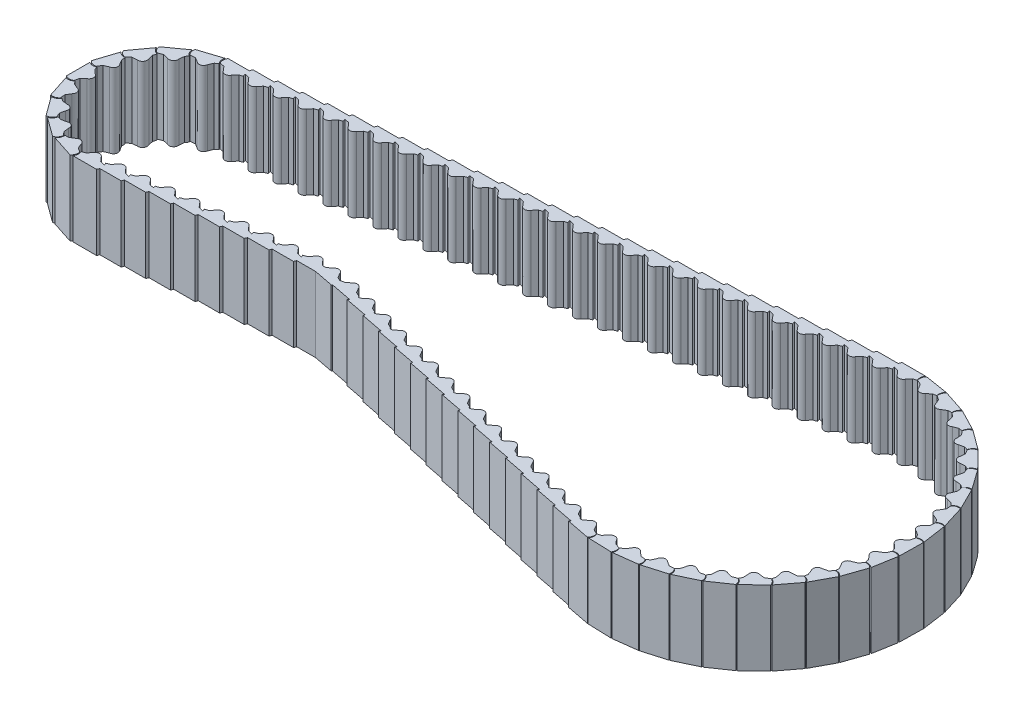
from build123d import *

# Parameters (mm, degrees)
BOSS_EXTRUDE1_DEPTH = 25.4


with BuildPart() as part:
    # Sketch1 → Boss-Extrude1 (new body)
    with BuildSketch(Plane(origin=(0, 0, 0), x_dir=(1, 0, 0), z_dir=(0, 1, 0))):
        with BuildLine():
            Line((207.13696801, 52.581174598), (199.083208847, 52.581174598))
            ThreePointArc((199.083208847, 52.581174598), (198.699168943, 51.289414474), (199.016239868, 49.979606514))
            Line((199.016239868, 49.979606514), (200.660264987, 49.57009816))
            Line((200.660264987, 49.57009816), (201.812198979, 48.267939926))
            ThreePointArc((201.812198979, 48.267939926), (203.2, 47.415), (204.587801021, 48.267939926))
            Line((204.587801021, 48.267939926), (205.739735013, 49.57009816))
            Line((205.739735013, 49.57009816), (206.893248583, 49.979606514))
            ThreePointArc((206.893248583, 49.979606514), (206.654642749, 51.314159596), (207.13696801, 52.581174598))
        make_face()
        with BuildLine():
            Line((215.399021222, 51.283447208), (207.446522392, 52.556553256))
            ThreePointArc((207.446522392, 52.556553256), (206.863114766, 51.341741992), (206.969149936, 49.998281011))
            Line((206.969149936, 49.998281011), (208.527771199, 49.334040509))
            Line((208.527771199, 49.334040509), (209.459381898, 47.866161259))
            ThreePointArc((209.459381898, 47.866161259), (210.694904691, 46.804567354), (212.20008615, 47.427405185))
            Line((212.20008615, 47.427405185), (213.543376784, 48.531098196))
            Line((213.543376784, 48.531098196), (214.747120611, 48.753114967))
            ThreePointArc((214.747120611, 48.753114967), (214.722475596, 50.1086065), (215.399021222, 51.283447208))
        make_face()
        with BuildLine():
            Line((223.352055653, 48.696003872), (215.700791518, 51.210202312))
            ThreePointArc((215.700791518, 51.210202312), (214.932686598, 50.102887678), (214.825019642, 48.759556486))
            Line((214.825019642, 48.759556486), (216.259043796, 47.857286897))
            Line((216.259043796, 47.857286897), (216.946904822, 46.260598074))
            ThreePointArc((216.946904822, 46.260598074), (217.999080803, 45.017045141), (219.583793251, 45.394118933))
            Line((219.583793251, 45.394118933), (221.084662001, 46.271593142))
            Line((221.084662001, 46.271593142), (222.308366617, 46.300535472))
            ThreePointArc((222.308366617, 46.300535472), (222.498302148, 47.642880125), (223.352055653, 48.696003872))
        make_face()
        with BuildLine():
            Line((230.79608347, 44.883908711), (223.638453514, 48.575977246))
            ThreePointArc((223.638453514, 48.575977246), (222.704966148, 47.604003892), (222.38630447, 46.294582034))
            Line((222.38630447, 46.294582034), (223.659671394, 45.176971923))
            Line((223.659671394, 45.176971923), (224.086485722, 43.491624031))
            ThreePointArc((224.086485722, 43.491624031), (224.928856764, 42.097382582), (226.553250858, 42.219210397))
            Line((226.553250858, 42.219210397), (228.173956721, 42.848400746))
            Line((228.173956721, 42.848400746), (229.386850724, 42.68354085))
            ThreePointArc((229.386850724, 42.68354085), (229.786590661, 43.978983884), (230.79608347, 44.883908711))
        make_face()
        with BuildLine():
            Line((237.543916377, 39.943021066), (231.059907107, 44.720118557))
            ThreePointArc((231.059907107, 44.720118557), (229.984510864, 43.907927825), (229.462867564, 42.665342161))
            Line((229.462867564, 42.665342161), (230.543557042, 41.360495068))
            Line((230.543557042, 41.360495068), (230.698591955, 39.628868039))
            ThreePointArc((230.698591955, 39.628868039), (231.309975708, 38.118997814), (232.933204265, 37.982516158))
            Line((232.933204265, 37.982516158), (234.632992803, 38.347600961))
            Line((234.632992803, 38.347600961), (235.804576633, 37.993084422))
            ThreePointArc((235.804576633, 37.993084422), (236.404069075, 39.209050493), (237.543916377, 39.943021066))
        make_face()
        with BuildLine():
            Line((243.425872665, 33.997585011), (237.778531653, 39.739586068))
            ThreePointArc((237.778531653, 39.739586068), (236.588268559, 39.107601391), (235.876760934, 37.963098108))
            Line((235.876760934, 37.963098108), (236.737597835, 36.503825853))
            Line((236.737597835, 36.503825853), (236.616954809, 34.769463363))
            ThreePointArc((236.616954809, 34.769463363), (236.981977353, 33.181931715), (238.563222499, 32.79057257))
            Line((238.563222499, 32.79057257), (240.299350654, 32.882371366))
            Line((240.299350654, 32.882371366), (241.400163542, 32.347112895))
            ThreePointArc((241.400163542, 32.347112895), (242.184333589, 33.453025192), (243.425872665, 33.997585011))
        make_face()
        with BuildLine():
            Line((248.294044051, 27.197105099), (243.625379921, 33.759620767))
            ThreePointArc((243.625379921, 33.759620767), (242.350180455, 33.323734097), (241.466700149, 32.306092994))
            Line((241.466700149, 32.306092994), (242.08603778, 30.72909059))
            Line((242.08603778, 30.72909059), (241.692750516, 29.035605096))
            ThreePointArc((241.692750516, 29.035605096), (241.802232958, 27.410332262), (243.301732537, 26.773936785))
            Line((243.301732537, 26.773936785), (245.030543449, 26.590141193))
            Line((245.030543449, 26.590141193), (246.032904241, 25.887600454))
            ThreePointArc((246.032904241, 25.887600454), (246.982033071, 26.855649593), (248.294044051, 27.197105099))
        make_face()
        with BuildLine():
            Line((252.026014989, 19.712586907), (248.453426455, 26.930595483))
            ThreePointArc((248.453426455, 26.930595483), (247.125356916, 26.701767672), (246.092120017, 25.836578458))
            Line((246.092120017, 25.836578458), (246.454384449, 24.181501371))
            Line((246.454384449, 24.181501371), (245.79834259, 22.571477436))
            ThreePointArc((245.79834259, 22.571477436), (245.649531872, 20.949332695), (247.029579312, 20.083903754))
            Line((247.029579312, 20.083903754), (248.707600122, 19.629135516))
            Line((248.707600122, 19.629135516), (249.586303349, 18.776978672))
            ThreePointArc((249.586303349, 18.776978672), (250.676524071, 19.582821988), (252.026014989, 19.712586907))
        make_face()
        with BuildLine():
            Line((254.527940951, 11.732236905), (252.141264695, 19.424233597))
            ThreePointArc((252.141264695, 19.424233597), (250.793720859, 19.408218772), (249.636709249, 18.717237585))
            Line((249.636709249, 18.717237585), (249.732790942, 17.025704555))
            Line((249.732790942, 17.025704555), (248.830491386, 15.539628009))
            ThreePointArc((248.830491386, 15.539628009), (248.427129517, 13.961401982), (249.653022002, 12.888701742))
            Line((249.653022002, 12.888701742), (251.238057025, 12.174396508))
            Line((251.238057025, 12.174396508), (251.971006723, 11.194051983))
            ThreePointArc((251.971006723, 11.194051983), (253.174904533, 11.817425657), (254.527940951, 11.732236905))
        make_face()
        with BuildLine():
            Line((255.736908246, 3.456729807), (254.596159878, 11.429290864))
            ThreePointArc((254.596159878, 11.429290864), (253.263027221, 11.626491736), (252.011335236, 11.127094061))
            Line((252.011335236, 11.127094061), (251.83881811, 9.441640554))
            Line((251.83881811, 9.441640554), (250.712950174, 8.116880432))
            ThreePointArc((250.712950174, 8.116880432), (250.065180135, 6.622259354), (251.106091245, 5.369262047))
            Line((251.106091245, 5.369262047), (252.558283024, 4.413381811))
            Line((252.558283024, 4.413381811), (253.127048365, 3.329501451))
            ThreePointArc((253.127048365, 3.329501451), (254.414349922, 3.754730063), (255.736908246, 3.456729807))
        make_face()
        with BuildLine():
            Line((255.622516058, -4.905837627), (255.756380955, 3.146808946))
            ThreePointArc((255.756380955, 3.146808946), (254.471182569, 3.552266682), (253.156285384, 3.257010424))
            Line((253.156285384, 3.257010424), (252.719507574, 1.620019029))
            Line((252.719507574, 1.620019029), (251.39838245, 0.489887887))
            ThreePointArc((251.39838245, 0.489887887), (250.522493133, -0.883544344), (251.352248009, -2.285330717))
            Line((251.352248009, -2.285330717), (252.635079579, -3.458749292))
            Line((252.635079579, -3.458749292), (253.02535833, -4.618910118))
            ThreePointArc((253.02535833, -4.618910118), (254.363693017, -4.402519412), (255.622516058, -4.905837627))
        make_face()
        with BuildLine():
            Line((254.187640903, -13.145179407), (255.592752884, -5.214940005))
            ThreePointArc((255.592752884, -5.214940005), (254.387806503, -4.611421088), (253.042768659, -4.695111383))
            Line((253.042768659, -4.695111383), (252.352713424, -6.24247671))
            Line((252.352713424, -6.24247671), (250.869552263, -7.149560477))
            ThreePointArc((250.869552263, -7.149560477), (249.787568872, -8.367267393), (250.385302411, -9.882593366))
            Line((250.385302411, -9.882593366), (251.466515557, -11.244043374))
            Line((251.466515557, -11.244043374), (251.668493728, -12.451311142))
            ThreePointArc((251.668493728, -12.451311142), (253.024207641, -12.449199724), (254.187640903, -13.145179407))
        make_face()
        with BuildLine():
            Line((251.468364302, -21.054108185), (254.109390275, -13.44569058))
            ThreePointArc((254.109390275, -13.44569058), (253.014995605, -12.659286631), (251.673639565, -12.52930648))
            Line((251.673639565, -12.52930648), (250.747659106, -13.94813553))
            Line((250.747659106, -13.94813553), (249.139757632, -14.609362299))
            ThreePointArc((249.139757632, -14.609362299), (247.878887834, -15.640723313), (248.229569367, -17.231484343))
            Line((248.229569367, -17.231484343), (249.081975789, -18.746730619))
            Line((249.081975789, -18.746730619), (249.090574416, -19.97074725))
            ThreePointArc((249.090574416, -19.97074725), (250.429576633, -20.182968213), (251.468364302, -21.054108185))
        make_face()
        with BuildLine():
            Line((247.533065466, -28.433745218), (251.343593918, -21.33847147))
            ThreePointArc((251.343593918, -21.33847147), (250.387270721, -20.388957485), (249.083326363, -20.048575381))
            Line((249.083326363, -20.048575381), (247.944705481, -21.303190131))
            Line((247.944705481, -21.303190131), (246.252496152, -21.701932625))
            ThreePointArc((246.252496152, -21.701932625), (244.84444591, -22.521013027), (244.939257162, -24.14720767))
            Line((244.939257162, -24.14720767), (245.541422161, -25.778147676))
            Line((245.541422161, -25.778147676), (245.356425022, -26.988133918))
            ThreePointArc((245.356425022, -26.988133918), (246.645044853, -27.409350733), (247.533065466, -28.433745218))
        make_face()
        with BuildLine():
            Line((242.480701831, -35.098521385), (247.364912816, -28.694809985))
            ThreePointArc((247.364912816, -28.694809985), (246.570708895, -27.606062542), (245.336965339, -27.063837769))
            Line((245.336965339, -27.063837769), (244.014335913, -28.122689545))
            Line((244.014335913, -28.122689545), (242.280371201, -28.248920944))
            ThreePointArc((242.280371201, -28.248920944), (240.760547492, -28.835124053), (240.597104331, -30.45585985))
            Line((240.597104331, -30.45585985), (240.933885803, -32.161481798))
            Line((240.933885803, -32.161481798), (240.559944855, -33.327011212))
            ThreePointArc((240.559944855, -33.327011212), (241.765778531, -33.946631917), (242.480701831, -35.098521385))
        make_face()
        with BuildLine():
            Line((236.438320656, -40.880843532), (242.273395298, -35.329722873))
            ThreePointArc((242.273395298, -35.329722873), (241.661281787, -34.129119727), (240.528762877, -33.398687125))
            Line((240.528762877, -33.398687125), (239.055383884, -34.235149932))
            Line((239.055383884, -34.235149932), (237.323266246, -34.085696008))
            ThreePointArc((237.323266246, -34.085696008), (235.729886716, -34.4242811), (235.312299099, -35.998802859))
            Line((235.312299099, -35.998802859), (235.375228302, -37.736217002))
            Line((235.375228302, -37.736217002), (234.821746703, -38.827981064))
            ThreePointArc((234.821746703, -38.827981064), (235.914472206, -39.630424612), (236.438320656, -40.880843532))
        make_face()
        with BuildLine():
            Line((229.557864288, -45.635308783), (236.197073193, -41.076367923))
            ThreePointArc((236.197073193, -41.076367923), (235.782442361, -39.794099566), (234.779626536, -38.893826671))
            Line((234.779626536, -38.893826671), (233.192547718, -39.486866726))
            Line((233.192547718, -39.486866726), (231.505833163, -39.065485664))
            ThreePointArc((231.505833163, -39.065485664), (229.878965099, -39.147938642), (229.217733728, -40.636653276))
            Line((229.217733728, -40.636653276), (229.005228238, -42.362170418))
            Line((229.005228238, -42.362170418), (228.286123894, -43.352715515))
            ThreePointArc((228.286123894, -43.352715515), (229.238263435, -44.317803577), (229.557864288, -45.635308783))
        make_face()
        with BuildLine():
            Line((222.012349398, -49.242360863), (229.288742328, -45.790239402))
            ThreePointArc((229.288742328, -45.790239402), (229.082020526, -44.458549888), (228.234124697, -43.411075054))
            Line((228.234124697, -43.411075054), (226.573254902, -43.745779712))
            Line((226.573254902, -43.745779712), (224.97435773, -43.063067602))
            ThreePointArc((224.97435773, -43.063067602), (223.354910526, -42.887315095), (222.466662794, -44.252787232))
            Line((222.466662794, -44.252787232), (221.984066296, -45.923017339))
            Line((221.984066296, -45.923017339), (221.11742188, -46.787435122))
            ThreePointArc((221.11742188, -46.787435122), (221.905032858, -47.890899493), (222.012349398, -49.242360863))
        make_face()
        with BuildLine():
            Line((213.991516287, -51.611296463), (221.722120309, -49.352801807))
            ThreePointArc((221.722120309, -49.352801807), (221.728505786, -48.005177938), (221.056851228, -46.836841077))
            Line((221.056851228, -46.836841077), (219.363954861, -46.90479382))
            Line((219.363954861, -46.90479382), (217.893081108, -45.977918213))
            ThreePointArc((217.893081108, -45.977918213), (216.321777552, -45.548379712), (215.228849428, -46.756273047))
            Line((215.228849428, -46.756273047), (214.488297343, -48.329216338))
            Line((214.488297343, -48.329216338), (213.495905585, -49.045770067))
            ThreePointArc((213.495905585, -49.045770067), (214.099182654, -50.259862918), (213.991516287, -51.611296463))
        make_face()
        with BuildLine():
            Line((205.69705766, -52.682546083), (213.687478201, -51.674470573))
            ThreePointArc((213.687478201, -51.674470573), (213.906810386, -50.34479984), (213.428286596, -49.084980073))
            Line((213.428286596, -49.084980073), (211.745933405, -48.884472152))
            Line((211.745933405, -48.884472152), (210.440069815, -47.736740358))
            ThreePointArc((210.440069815, -47.736740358), (208.956422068, -47.064217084), (207.686296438, -48.084157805))
            Line((207.686296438, -48.084157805), (206.706410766, -49.520260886))
            Line((206.706410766, -49.520260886), (205.613226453, -50.070932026))
            ThreePointArc((205.613226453, -50.070932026), (206.016999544, -51.365123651), (205.69705766, -52.682546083))
        make_face()
        with BuildLine():
            Line((197.337546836, -52.429171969), (205.38685595, -52.696864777))
            ThreePointArc((205.38685595, -52.696864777), (205.813619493, -51.418583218), (205.54025948, -50.098960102))
            Line((205.54025948, -50.098960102), (203.910754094, -49.635033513))
            Line((203.910754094, -49.635033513), (202.802738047, -48.295306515))
            ThreePointArc((202.802738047, -48.295306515), (201.444054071, -47.396709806), (200.028669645, -48.203050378))
            Line((200.028669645, -48.203050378), (198.834090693, -49.466200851))
            Line((198.834090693, -49.466200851), (197.667603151, -49.837142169))
            ThreePointArc((197.667603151, -49.837142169), (197.861718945, -51.178888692), (197.337546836, -52.429171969))
        make_face()
        with BuildLine():
            Line((189.123192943, -50.857545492), (197.028981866, -52.394275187))
            ThreePointArc((197.028981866, -52.394275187), (197.652445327, -51.199526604), (197.591123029, -49.85328352))
            Line((197.591123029, -49.85328352), (196.05544116, -49.137604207))
            Line((196.05544116, -49.137604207), (195.173134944, -47.639570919))
            ThreePointArc((195.173134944, -47.639570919), (193.973580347, -46.537496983), (192.44852853, -47.109961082))
            Line((192.44852853, -47.109961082), (191.069295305, -48.168395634))
            Line((191.069295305, -48.168395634), (189.858837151, -48.3502794))
            ThreePointArc((189.858837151, -48.3502794), (189.83841439, -49.705841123), (189.123192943, -50.857545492))
        make_face()
        with BuildLine():
            Line((181.762838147, -48.885344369), (189.66862707, -50.422074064))
            ThreePointArc((189.66862707, -50.422074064), (190.292090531, -49.22732548), (190.230768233, -47.881082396))
            Line((190.230768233, -47.881082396), (188.695086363, -47.165403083))
            Line((188.695086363, -47.165403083), (187.812780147, -45.667369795))
            ThreePointArc((187.812780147, -45.667369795), (186.613225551, -44.56529586), (185.088173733, -45.137759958))
            Line((185.088173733, -45.137759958), (183.708940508, -46.19619451))
            Line((183.708940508, -46.19619451), (182.498482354, -46.378078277))
            ThreePointArc((182.498482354, -46.378078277), (182.478059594, -47.733639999), (181.762838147, -48.885344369))
        make_face()
        with BuildLine():
            Line((174.40248335, -46.913143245), (182.308272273, -48.44987294))
            ThreePointArc((182.308272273, -48.44987294), (182.931735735, -47.255124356), (182.870413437, -45.908881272))
            Line((182.870413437, -45.908881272), (181.334731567, -45.193201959))
            Line((181.334731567, -45.193201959), (180.452425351, -43.695168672))
            ThreePointArc((180.452425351, -43.695168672), (179.252870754, -42.593094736), (177.727818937, -43.165558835))
            Line((177.727818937, -43.165558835), (176.348585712, -44.223993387))
            Line((176.348585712, -44.223993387), (175.138127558, -44.405877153))
            ThreePointArc((175.138127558, -44.405877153), (175.117704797, -45.761438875), (174.40248335, -46.913143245))
        make_face()
        with BuildLine():
            Line((167.042128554, -44.940942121), (174.947917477, -46.477671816))
            ThreePointArc((174.947917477, -46.477671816), (175.571380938, -45.282923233), (175.51005864, -43.936680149))
            Line((175.51005864, -43.936680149), (173.974376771, -43.221000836))
            Line((173.974376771, -43.221000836), (173.092070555, -41.722967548))
            ThreePointArc((173.092070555, -41.722967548), (171.892515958, -40.620893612), (170.367464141, -41.193357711))
            Line((170.367464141, -41.193357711), (168.988230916, -42.251792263))
            Line((168.988230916, -42.251792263), (167.777772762, -42.433676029))
            ThreePointArc((167.777772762, -42.433676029), (167.757350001, -43.789237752), (167.042128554, -44.940942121))
        make_face()
        with BuildLine():
            Line((159.681773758, -42.968740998), (167.587562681, -44.505470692))
            ThreePointArc((167.587562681, -44.505470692), (168.211026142, -43.310722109), (168.149703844, -41.964479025))
            Line((168.149703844, -41.964479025), (166.614021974, -41.248799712))
            Line((166.614021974, -41.248799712), (165.731715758, -39.750766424))
            ThreePointArc((165.731715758, -39.750766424), (164.532161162, -38.648692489), (163.007109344, -39.221156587))
            Line((163.007109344, -39.221156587), (161.627876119, -40.279591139))
            Line((161.627876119, -40.279591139), (160.417417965, -40.461474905))
            ThreePointArc((160.417417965, -40.461474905), (160.396995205, -41.817036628), (159.681773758, -42.968740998))
        make_face()
        with BuildLine():
            Line((152.321418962, -40.996539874), (160.227207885, -42.533269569))
            ThreePointArc((160.227207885, -42.533269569), (160.850671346, -41.338520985), (160.789349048, -39.992277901))
            Line((160.789349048, -39.992277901), (159.253667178, -39.276598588))
            Line((159.253667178, -39.276598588), (158.371360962, -37.778565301))
            ThreePointArc((158.371360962, -37.778565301), (157.171806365, -36.676491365), (155.646754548, -37.248955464))
            Line((155.646754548, -37.248955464), (154.267521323, -38.307390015))
            Line((154.267521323, -38.307390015), (153.057063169, -38.489273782))
            ThreePointArc((153.057063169, -38.489273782), (153.036640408, -39.844835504), (152.321418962, -40.996539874))
        make_face()
        with BuildLine():
            Line((144.961064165, -39.02433875), (152.866853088, -40.561068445))
            ThreePointArc((152.866853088, -40.561068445), (153.490316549, -39.366319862), (153.428994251, -38.020076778))
            Line((153.428994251, -38.020076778), (151.893312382, -37.304397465))
            Line((151.893312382, -37.304397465), (151.011006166, -35.806364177))
            ThreePointArc((151.011006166, -35.806364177), (149.811451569, -34.704290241), (148.286399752, -35.27675434))
            Line((148.286399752, -35.27675434), (146.907166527, -36.335188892))
            Line((146.907166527, -36.335188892), (145.696708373, -36.517072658))
            ThreePointArc((145.696708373, -36.517072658), (145.676285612, -37.872634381), (144.961064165, -39.02433875))
        make_face()
        with BuildLine():
            Line((137.600709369, -37.052137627), (145.506498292, -38.588867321))
            ThreePointArc((145.506498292, -38.588867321), (146.129961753, -37.394118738), (146.068639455, -36.047875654))
            Line((146.068639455, -36.047875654), (144.532957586, -35.332196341))
            Line((144.532957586, -35.332196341), (143.650651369, -33.834163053))
            ThreePointArc((143.650651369, -33.834163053), (142.451096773, -32.732089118), (140.926044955, -33.304553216))
            Line((140.926044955, -33.304553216), (139.54681173, -34.362987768))
            Line((139.54681173, -34.362987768), (138.336353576, -34.544871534))
            ThreePointArc((138.336353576, -34.544871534), (138.315930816, -35.900433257), (137.600709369, -37.052137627))
        make_face()
        with BuildLine():
            Line((130.240354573, -35.079936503), (138.146143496, -36.616666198))
            ThreePointArc((138.146143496, -36.616666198), (138.769606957, -35.421917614), (138.708284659, -34.07567453))
            Line((138.708284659, -34.07567453), (137.172602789, -33.359995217))
            Line((137.172602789, -33.359995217), (136.290296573, -31.86196193))
            ThreePointArc((136.290296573, -31.86196193), (135.090741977, -30.759887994), (133.565690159, -31.332352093))
            Line((133.565690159, -31.332352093), (132.186456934, -32.390786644))
            Line((132.186456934, -32.390786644), (130.97599878, -32.572670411))
            ThreePointArc((130.97599878, -32.572670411), (130.95557602, -33.928232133), (130.240354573, -35.079936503))
        make_face()
        with BuildLine():
            Line((122.879999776, -33.107735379), (130.785788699, -34.644465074))
            ThreePointArc((130.785788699, -34.644465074), (131.40925216, -33.44971649), (131.347929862, -32.103473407))
            Line((131.347929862, -32.103473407), (129.812247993, -31.387794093))
            Line((129.812247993, -31.387794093), (128.929941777, -29.889760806))
            ThreePointArc((128.929941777, -29.889760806), (127.73038718, -28.78768687), (126.205335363, -29.360150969))
            Line((126.205335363, -29.360150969), (124.826102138, -30.418585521))
            Line((124.826102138, -30.418585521), (123.615643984, -30.600469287))
            ThreePointArc((123.615643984, -30.600469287), (123.595221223, -31.95603101), (122.879999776, -33.107735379))
        make_face()
        with BuildLine():
            Line((115.51964498, -31.135534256), (123.425433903, -32.67226395))
            ThreePointArc((123.425433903, -32.67226395), (124.048897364, -31.477515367), (123.987575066, -30.131272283))
            Line((123.987575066, -30.131272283), (122.451893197, -29.41559297))
            Line((122.451893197, -29.41559297), (121.569586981, -27.917559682))
            ThreePointArc((121.569586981, -27.917559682), (120.370032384, -26.815485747), (118.844980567, -27.387949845))
            Line((118.844980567, -27.387949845), (117.465747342, -28.446384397))
            Line((117.465747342, -28.446384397), (116.255289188, -28.628268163))
            ThreePointArc((116.255289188, -28.628268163), (116.234866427, -29.983829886), (115.51964498, -31.135534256))
        make_face()
        with BuildLine():
            Line((108.159290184, -29.163333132), (116.065079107, -30.700062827))
            ThreePointArc((116.065079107, -30.700062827), (116.688542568, -29.505314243), (116.62722027, -28.159071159))
            Line((116.62722027, -28.159071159), (115.0915384, -27.443391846))
            Line((115.0915384, -27.443391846), (114.209232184, -25.945358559))
            ThreePointArc((114.209232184, -25.945358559), (113.009677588, -24.843284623), (111.48462577, -25.415748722))
            Line((111.48462577, -25.415748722), (110.105392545, -26.474183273))
            Line((110.105392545, -26.474183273), (108.894934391, -26.65606704))
            ThreePointArc((108.894934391, -26.65606704), (108.874511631, -28.011628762), (108.159290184, -29.163333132))
        make_face()
        with BuildLine():
            Line((100.798935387, -27.191132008), (108.70472431, -28.727861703))
            ThreePointArc((108.70472431, -28.727861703), (109.328187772, -27.533113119), (109.266865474, -26.186870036))
            Line((109.266865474, -26.186870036), (107.731183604, -25.471190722))
            Line((107.731183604, -25.471190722), (106.848877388, -23.973157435))
            ThreePointArc((106.848877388, -23.973157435), (105.649322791, -22.871083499), (104.124270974, -23.443547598))
            Line((104.124270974, -23.443547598), (102.745037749, -24.50198215))
            Line((102.745037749, -24.50198215), (101.534579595, -24.683865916))
            ThreePointArc((101.534579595, -24.683865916), (101.514156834, -26.039427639), (100.798935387, -27.191132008))
        make_face()
        with BuildLine():
            Line((93.438580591, -25.218930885), (101.344369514, -26.755660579))
            ThreePointArc((101.344369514, -26.755660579), (101.967832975, -25.560911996), (101.906510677, -24.214668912))
            Line((101.906510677, -24.214668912), (100.370828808, -23.498989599))
            Line((100.370828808, -23.498989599), (99.488522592, -22.000956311))
            ThreePointArc((99.488522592, -22.000956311), (98.288967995, -20.898882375), (96.763916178, -21.471346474))
            Line((96.763916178, -21.471346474), (95.384682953, -22.529781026))
            Line((95.384682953, -22.529781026), (94.174224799, -22.711664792))
            ThreePointArc((94.174224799, -22.711664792), (94.153802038, -24.067226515), (93.438580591, -25.218930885))
        make_face()
        with BuildLine():
            Line((86.078225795, -23.246729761), (93.984014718, -24.783459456))
            ThreePointArc((93.984014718, -24.783459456), (94.607478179, -23.588710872), (94.546155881, -22.242467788))
            Line((94.546155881, -22.242467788), (93.010474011, -21.526788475))
            Line((93.010474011, -21.526788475), (92.128167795, -20.028755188))
            ThreePointArc((92.128167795, -20.028755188), (90.928613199, -18.926681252), (89.403561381, -19.499145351))
            Line((89.403561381, -19.499145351), (88.024328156, -20.557579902))
            Line((88.024328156, -20.557579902), (86.813870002, -20.739463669))
            ThreePointArc((86.813870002, -20.739463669), (86.793447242, -22.095025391), (86.078225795, -23.246729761))
        make_face()
        with BuildLine():
            Line((78.717870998, -21.274528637), (86.623659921, -22.811258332))
            ThreePointArc((86.623659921, -22.811258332), (87.247123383, -21.616509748), (87.185801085, -20.270266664))
            Line((87.185801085, -20.270266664), (85.650119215, -19.554587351))
            Line((85.650119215, -19.554587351), (84.767812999, -18.056554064))
            ThreePointArc((84.767812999, -18.056554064), (83.568258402, -16.954480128), (82.043206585, -17.526944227))
            Line((82.043206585, -17.526944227), (80.66397336, -18.585378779))
            Line((80.66397336, -18.585378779), (79.453515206, -18.767262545))
            ThreePointArc((79.453515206, -18.767262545), (79.433092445, -20.122824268), (78.717870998, -21.274528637))
        make_face()
        with BuildLine():
            Line((199.573766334, 51.652530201), (191.520007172, 51.652530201))
            ThreePointArc((191.520007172, 51.652530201), (191.135967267, 50.360770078), (191.453038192, 49.050962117))
            Line((191.453038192, 49.050962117), (193.097063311, 48.641453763))
            Line((193.097063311, 48.641453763), (194.248997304, 47.339295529))
            ThreePointArc((194.248997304, 47.339295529), (195.636798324, 46.486355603), (197.024599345, 47.339295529))
            Line((197.024599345, 47.339295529), (198.176533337, 48.641453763))
            Line((198.176533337, 48.641453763), (199.330046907, 49.050962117))
            ThreePointArc((199.330046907, 49.050962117), (199.091441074, 50.385515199), (199.573766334, 51.652530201))
        make_face()
        with BuildLine():
            Line((192.010564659, 50.723885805), (183.956805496, 50.723885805))
            ThreePointArc((183.956805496, 50.723885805), (183.572765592, 49.432125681), (183.889836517, 48.12231772))
            Line((183.889836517, 48.12231772), (185.533861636, 47.712809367))
            Line((185.533861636, 47.712809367), (186.685795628, 46.410651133))
            ThreePointArc((186.685795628, 46.410651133), (188.073596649, 45.557711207), (189.46139767, 46.410651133))
            Line((189.46139767, 46.410651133), (190.613331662, 47.712809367))
            Line((190.613331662, 47.712809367), (191.766845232, 48.12231772))
            ThreePointArc((191.766845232, 48.12231772), (191.528239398, 49.456870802), (192.010564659, 50.723885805))
        make_face()
        with BuildLine():
            Line((184.447362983, 49.795241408), (176.393603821, 49.795241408))
            ThreePointArc((176.393603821, 49.795241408), (176.009563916, 48.503481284), (176.326634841, 47.193673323))
            Line((176.326634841, 47.193673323), (177.97065996, 46.78416497))
            Line((177.97065996, 46.78416497), (179.122593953, 45.482006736))
            ThreePointArc((179.122593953, 45.482006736), (180.510394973, 44.62906681), (181.898195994, 45.482006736))
            Line((181.898195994, 45.482006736), (183.050129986, 46.78416497))
            Line((183.050129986, 46.78416497), (184.203643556, 47.193673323))
            ThreePointArc((184.203643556, 47.193673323), (183.965037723, 48.528226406), (184.447362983, 49.795241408))
        make_face()
        with BuildLine():
            Line((176.884161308, 48.866597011), (168.830402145, 48.866597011))
            ThreePointArc((168.830402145, 48.866597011), (168.446362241, 47.574836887), (168.763433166, 46.265028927))
            Line((168.763433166, 46.265028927), (170.407458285, 45.855520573))
            Line((170.407458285, 45.855520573), (171.559392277, 44.553362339))
            ThreePointArc((171.559392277, 44.553362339), (172.947193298, 43.700422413), (174.334994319, 44.553362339))
            Line((174.334994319, 44.553362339), (175.486928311, 45.855520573))
            Line((175.486928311, 45.855520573), (176.640441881, 46.265028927))
            ThreePointArc((176.640441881, 46.265028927), (176.401836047, 47.599582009), (176.884161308, 48.866597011))
        make_face()
        with BuildLine():
            Line((169.320959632, 47.937952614), (161.26720047, 47.937952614))
            ThreePointArc((161.26720047, 47.937952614), (160.883160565, 46.646192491), (161.20023149, 45.33638453))
            Line((161.20023149, 45.33638453), (162.844256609, 44.926876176))
            Line((162.844256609, 44.926876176), (163.996190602, 43.624717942))
            ThreePointArc((163.996190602, 43.624717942), (165.383991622, 42.771778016), (166.771792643, 43.624717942))
            Line((166.771792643, 43.624717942), (167.923726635, 44.926876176))
            Line((167.923726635, 44.926876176), (169.077240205, 45.33638453))
            ThreePointArc((169.077240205, 45.33638453), (168.838634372, 46.670937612), (169.320959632, 47.937952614))
        make_face()
        with BuildLine():
            Line((161.757757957, 47.009308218), (153.703998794, 47.009308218))
            ThreePointArc((153.703998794, 47.009308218), (153.31995889, 45.717548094), (153.637029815, 44.407740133))
            Line((153.637029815, 44.407740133), (155.281054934, 43.99823178))
            Line((155.281054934, 43.99823178), (156.432988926, 42.696073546))
            ThreePointArc((156.432988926, 42.696073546), (157.820789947, 41.84313362), (159.208590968, 42.696073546))
            Line((159.208590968, 42.696073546), (160.36052496, 43.99823178))
            Line((160.36052496, 43.99823178), (161.51403853, 44.407740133))
            ThreePointArc((161.51403853, 44.407740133), (161.275432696, 45.742293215), (161.757757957, 47.009308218))
        make_face()
        with BuildLine():
            Line((154.194556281, 46.080663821), (146.140797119, 46.080663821))
            ThreePointArc((146.140797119, 46.080663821), (145.756757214, 44.788903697), (146.073828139, 43.479095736))
            Line((146.073828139, 43.479095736), (147.717853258, 43.069587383))
            Line((147.717853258, 43.069587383), (148.869787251, 41.767429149))
            ThreePointArc((148.869787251, 41.767429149), (150.257588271, 40.914489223), (151.645389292, 41.767429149))
            Line((151.645389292, 41.767429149), (152.797323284, 43.069587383))
            Line((152.797323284, 43.069587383), (153.950836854, 43.479095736))
            ThreePointArc((153.950836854, 43.479095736), (153.712231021, 44.813648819), (154.194556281, 46.080663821))
        make_face()
        with BuildLine():
            Line((146.631354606, 45.152019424), (138.577595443, 45.152019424))
            ThreePointArc((138.577595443, 45.152019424), (138.193555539, 43.8602593), (138.510626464, 42.55045134))
            Line((138.510626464, 42.55045134), (140.154651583, 42.140942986))
            Line((140.154651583, 42.140942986), (141.306585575, 40.838784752))
            ThreePointArc((141.306585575, 40.838784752), (142.694386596, 39.985844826), (144.082187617, 40.838784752))
            Line((144.082187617, 40.838784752), (145.234121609, 42.140942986))
            Line((145.234121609, 42.140942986), (146.387635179, 42.55045134))
            ThreePointArc((146.387635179, 42.55045134), (146.149029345, 43.885004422), (146.631354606, 45.152019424))
        make_face()
        with BuildLine():
            Line((139.06815293, 44.223375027), (131.014393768, 44.223375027))
            ThreePointArc((131.014393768, 44.223375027), (130.630353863, 42.931614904), (130.947424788, 41.621806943))
            Line((130.947424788, 41.621806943), (132.591449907, 41.212298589))
            Line((132.591449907, 41.212298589), (133.7433839, 39.910140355))
            ThreePointArc((133.7433839, 39.910140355), (135.13118492, 39.057200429), (136.518985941, 39.910140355))
            Line((136.518985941, 39.910140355), (137.670919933, 41.212298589))
            Line((137.670919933, 41.212298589), (138.824433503, 41.621806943))
            ThreePointArc((138.824433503, 41.621806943), (138.58582767, 42.956360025), (139.06815293, 44.223375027))
        make_face()
        with BuildLine():
            Line((131.504951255, 43.294730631), (123.451192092, 43.294730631))
            ThreePointArc((123.451192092, 43.294730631), (123.067152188, 42.002970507), (123.384223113, 40.693162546))
            Line((123.384223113, 40.693162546), (125.028248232, 40.283654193))
            Line((125.028248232, 40.283654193), (126.180182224, 38.981495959))
            ThreePointArc((126.180182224, 38.981495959), (127.567983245, 38.128556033), (128.955784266, 38.981495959))
            Line((128.955784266, 38.981495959), (130.107718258, 40.283654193))
            Line((130.107718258, 40.283654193), (131.261231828, 40.693162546))
            ThreePointArc((131.261231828, 40.693162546), (131.022625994, 42.027715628), (131.504951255, 43.294730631))
        make_face()
        with BuildLine():
            Line((123.941749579, 42.366086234), (115.887990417, 42.366086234))
            ThreePointArc((115.887990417, 42.366086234), (115.503950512, 41.07432611), (115.821021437, 39.764518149))
            Line((115.821021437, 39.764518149), (117.465046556, 39.355009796))
            Line((117.465046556, 39.355009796), (118.616980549, 38.052851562))
            ThreePointArc((118.616980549, 38.052851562), (120.004781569, 37.199911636), (121.39258259, 38.052851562))
            Line((121.39258259, 38.052851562), (122.544516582, 39.355009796))
            Line((122.544516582, 39.355009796), (123.698030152, 39.764518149))
            ThreePointArc((123.698030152, 39.764518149), (123.459424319, 41.099071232), (123.941749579, 42.366086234))
        make_face()
        with BuildLine():
            Line((116.378547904, 41.437441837), (108.324788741, 41.437441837))
            ThreePointArc((108.324788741, 41.437441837), (107.940748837, 40.145681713), (108.257819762, 38.835873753))
            Line((108.257819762, 38.835873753), (109.901844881, 38.426365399))
            Line((109.901844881, 38.426365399), (111.053778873, 37.124207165))
            ThreePointArc((111.053778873, 37.124207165), (112.441579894, 36.271267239), (113.829380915, 37.124207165))
            Line((113.829380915, 37.124207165), (114.981314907, 38.426365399))
            Line((114.981314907, 38.426365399), (116.134828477, 38.835873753))
            ThreePointArc((116.134828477, 38.835873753), (115.896222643, 40.170426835), (116.378547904, 41.437441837))
        make_face()
        with BuildLine():
            Line((108.815346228, 40.50879744), (100.761587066, 40.50879744))
            ThreePointArc((100.761587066, 40.50879744), (100.377547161, 39.217037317), (100.694618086, 37.907229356))
            Line((100.694618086, 37.907229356), (102.338643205, 37.497721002))
            Line((102.338643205, 37.497721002), (103.490577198, 36.195562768))
            ThreePointArc((103.490577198, 36.195562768), (104.878378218, 35.342622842), (106.266179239, 36.195562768))
            Line((106.266179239, 36.195562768), (107.418113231, 37.497721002))
            Line((107.418113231, 37.497721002), (108.571626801, 37.907229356))
            ThreePointArc((108.571626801, 37.907229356), (108.333020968, 39.241782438), (108.815346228, 40.50879744))
        make_face()
        with BuildLine():
            Line((101.252144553, 39.580153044), (93.19838539, 39.580153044))
            ThreePointArc((93.19838539, 39.580153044), (92.814345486, 38.28839292), (93.131416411, 36.978584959))
            Line((93.131416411, 36.978584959), (94.77544153, 36.569076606))
            Line((94.77544153, 36.569076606), (95.927375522, 35.266918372))
            ThreePointArc((95.927375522, 35.266918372), (97.315176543, 34.413978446), (98.702977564, 35.266918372))
            Line((98.702977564, 35.266918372), (99.854911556, 36.569076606))
            Line((99.854911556, 36.569076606), (101.008425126, 36.978584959))
            ThreePointArc((101.008425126, 36.978584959), (100.769819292, 38.313138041), (101.252144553, 39.580153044))
        make_face()
        with BuildLine():
            Line((93.688942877, 38.651508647), (85.635183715, 38.651508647))
            ThreePointArc((85.635183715, 38.651508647), (85.25114381, 37.359748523), (85.568214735, 36.049940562))
            Line((85.568214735, 36.049940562), (87.212239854, 35.640432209))
            Line((87.212239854, 35.640432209), (88.364173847, 34.338273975))
            ThreePointArc((88.364173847, 34.338273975), (89.751974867, 33.485334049), (91.139775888, 34.338273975))
            Line((91.139775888, 34.338273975), (92.29170988, 35.640432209))
            Line((92.29170988, 35.640432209), (93.44522345, 36.049940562))
            ThreePointArc((93.44522345, 36.049940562), (93.206617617, 37.384493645), (93.688942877, 38.651508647))
        make_face()
        with BuildLine():
            Line((86.125741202, 37.72286425), (78.071982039, 37.72286425))
            ThreePointArc((78.071982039, 37.72286425), (77.687942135, 36.431104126), (78.00501306, 35.121296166))
            Line((78.00501306, 35.121296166), (79.649038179, 34.711787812))
            Line((79.649038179, 34.711787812), (80.800972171, 33.409629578))
            ThreePointArc((80.800972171, 33.409629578), (82.188773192, 32.556689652), (83.576574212, 33.409629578))
            Line((83.576574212, 33.409629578), (84.728508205, 34.711787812))
            Line((84.728508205, 34.711787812), (85.882021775, 35.121296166))
            ThreePointArc((85.882021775, 35.121296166), (85.643415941, 36.455849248), (86.125741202, 37.72286425))
        make_face()
        with BuildLine():
            Line((78.562539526, 36.794219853), (70.508780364, 36.794219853))
            ThreePointArc((70.508780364, 36.794219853), (70.124740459, 35.50245973), (70.441811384, 34.192651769))
            Line((70.441811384, 34.192651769), (72.085836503, 33.783143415))
            Line((72.085836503, 33.783143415), (73.237770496, 32.480985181))
            ThreePointArc((73.237770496, 32.480985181), (74.625571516, 31.628045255), (76.013372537, 32.480985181))
            Line((76.013372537, 32.480985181), (77.165306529, 33.783143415))
            Line((77.165306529, 33.783143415), (78.318820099, 34.192651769))
            ThreePointArc((78.318820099, 34.192651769), (78.080214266, 35.527204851), (78.562539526, 36.794219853))
        make_face()
        with BuildLine():
            Line((70.999337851, 35.865575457), (62.945578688, 35.865575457))
            ThreePointArc((62.945578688, 35.865575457), (62.561538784, 34.573815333), (62.878609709, 33.264007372))
            Line((62.878609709, 33.264007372), (64.522634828, 32.854499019))
            Line((64.522634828, 32.854499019), (65.67456882, 31.552340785))
            ThreePointArc((65.67456882, 31.552340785), (67.062369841, 30.699400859), (68.450170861, 31.552340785))
            Line((68.450170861, 31.552340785), (69.602104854, 32.854499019))
            Line((69.602104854, 32.854499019), (70.755618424, 33.264007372))
            ThreePointArc((70.755618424, 33.264007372), (70.51701259, 34.598560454), (70.999337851, 35.865575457))
        make_face()
        with BuildLine():
            Line((63.436136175, 34.93693106), (55.382377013, 34.93693106))
            ThreePointArc((55.382377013, 34.93693106), (54.998337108, 33.645170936), (55.315408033, 32.335362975))
            Line((55.315408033, 32.335362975), (56.959433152, 31.925854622))
            Line((56.959433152, 31.925854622), (58.111367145, 30.623696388))
            ThreePointArc((58.111367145, 30.623696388), (59.499168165, 29.770756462), (60.886969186, 30.623696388))
            Line((60.886969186, 30.623696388), (62.038903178, 31.925854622))
            Line((62.038903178, 31.925854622), (63.192416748, 32.335362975))
            ThreePointArc((63.192416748, 32.335362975), (62.953810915, 33.669916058), (63.436136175, 34.93693106))
        make_face()
        with BuildLine():
            Line((55.8729345, 34.008286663), (47.819175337, 34.008286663))
            ThreePointArc((47.819175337, 34.008286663), (47.435135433, 32.716526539), (47.752206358, 31.406718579))
            Line((47.752206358, 31.406718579), (49.396231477, 30.997210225))
            Line((49.396231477, 30.997210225), (50.548165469, 29.695051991))
            ThreePointArc((50.548165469, 29.695051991), (51.93596649, 28.842112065), (53.32376751, 29.695051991))
            Line((53.32376751, 29.695051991), (54.475701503, 30.997210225))
            Line((54.475701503, 30.997210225), (55.629215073, 31.406718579))
            ThreePointArc((55.629215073, 31.406718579), (55.390609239, 32.741271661), (55.8729345, 34.008286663))
        make_face()
        with BuildLine():
            Line((48.309732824, 33.079642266), (40.255973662, 33.079642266))
            ThreePointArc((40.255973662, 33.079642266), (39.871933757, 31.787882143), (40.189004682, 30.478074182))
            Line((40.189004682, 30.478074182), (41.833029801, 30.068565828))
            Line((41.833029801, 30.068565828), (42.984963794, 28.766407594))
            ThreePointArc((42.984963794, 28.766407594), (44.372764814, 27.913467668), (45.760565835, 28.766407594))
            Line((45.760565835, 28.766407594), (46.912499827, 30.068565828))
            Line((46.912499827, 30.068565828), (48.066013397, 30.478074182))
            ThreePointArc((48.066013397, 30.478074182), (47.827407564, 31.812627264), (48.309732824, 33.079642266))
        make_face()
        with BuildLine():
            Line((40.746531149, 32.15099787), (32.692771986, 32.15099787))
            ThreePointArc((32.692771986, 32.15099787), (32.308732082, 30.859237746), (32.625803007, 29.549429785))
            Line((32.625803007, 29.549429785), (34.269828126, 29.139921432))
            Line((34.269828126, 29.139921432), (35.421762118, 27.837763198))
            ThreePointArc((35.421762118, 27.837763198), (36.809563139, 26.984823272), (38.197364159, 27.837763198))
            Line((38.197364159, 27.837763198), (39.349298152, 29.139921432))
            Line((39.349298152, 29.139921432), (40.502811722, 29.549429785))
            ThreePointArc((40.502811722, 29.549429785), (40.264205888, 30.883982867), (40.746531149, 32.15099787))
        make_face()
        with BuildLine():
            Line((33.183329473, 31.222353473), (25.129570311, 31.222353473))
            ThreePointArc((25.129570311, 31.222353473), (24.745530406, 29.930593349), (25.062601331, 28.620785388))
            Line((25.062601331, 28.620785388), (26.70662645, 28.211277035))
            Line((26.70662645, 28.211277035), (27.858560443, 26.909118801))
            ThreePointArc((27.858560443, 26.909118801), (29.246361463, 26.056178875), (30.634162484, 26.909118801))
            Line((30.634162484, 26.909118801), (31.786096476, 28.211277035))
            Line((31.786096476, 28.211277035), (32.939610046, 28.620785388))
            ThreePointArc((32.939610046, 28.620785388), (32.701004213, 29.955338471), (33.183329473, 31.222353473))
        make_face()
        with BuildLine():
            Line((25.620127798, 30.293709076), (17.566368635, 30.293709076))
            ThreePointArc((17.566368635, 30.293709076), (17.182328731, 29.001948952), (17.499399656, 27.692140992))
            Line((17.499399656, 27.692140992), (19.143424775, 27.282632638))
            Line((19.143424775, 27.282632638), (20.295358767, 25.980474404))
            ThreePointArc((20.295358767, 25.980474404), (21.683159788, 25.127534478), (23.070960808, 25.980474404))
            Line((23.070960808, 25.980474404), (24.222894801, 27.282632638))
            Line((24.222894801, 27.282632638), (25.376408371, 27.692140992))
            ThreePointArc((25.376408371, 27.692140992), (25.137802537, 29.026694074), (25.620127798, 30.293709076))
        make_face()
        with BuildLine():
            Line((18.056926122, 29.365064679), (10.00316696, 29.365064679))
            ThreePointArc((10.00316696, 29.365064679), (9.619127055, 28.073304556), (9.93619798, 26.763496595))
            Line((9.93619798, 26.763496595), (11.580223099, 26.353988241))
            Line((11.580223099, 26.353988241), (12.732157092, 25.051830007))
            ThreePointArc((12.732157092, 25.051830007), (14.119958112, 24.198890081), (15.507759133, 25.051830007))
            Line((15.507759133, 25.051830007), (16.659693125, 26.353988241))
            Line((16.659693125, 26.353988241), (17.813206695, 26.763496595))
            ThreePointArc((17.813206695, 26.763496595), (17.574600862, 28.098049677), (18.056926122, 29.365064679))
        make_face()
        with BuildLine():
            Line((10.493724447, 28.436420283), (2.439965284, 28.436420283))
            ThreePointArc((2.439965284, 28.436420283), (2.05592538, 27.144660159), (2.372996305, 25.834852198))
            Line((2.372996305, 25.834852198), (4.017021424, 25.425343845))
            Line((4.017021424, 25.425343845), (5.168955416, 24.123185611))
            ThreePointArc((5.168955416, 24.123185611), (6.556756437, 23.270245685), (7.944557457, 24.123185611))
            Line((7.944557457, 24.123185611), (9.09649145, 25.425343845))
            Line((9.09649145, 25.425343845), (10.25000502, 25.834852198))
            ThreePointArc((10.25000502, 25.834852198), (10.011399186, 27.16940528), (10.493724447, 28.436420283))
        make_face()
        with BuildLine():
            Line((2.930522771, 27.507775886), (-5.123236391, 27.507775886))
            ThreePointArc((-5.123236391, 27.507775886), (-5.507276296, 26.216015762), (-5.190205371, 24.906207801))
            Line((-5.190205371, 24.906207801), (-3.546180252, 24.496699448))
            Line((-3.546180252, 24.496699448), (-2.394246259, 23.194541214))
            ThreePointArc((-2.394246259, 23.194541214), (-1.006445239, 22.341601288), (0.381355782, 23.194541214))
            Line((0.381355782, 23.194541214), (1.533289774, 24.496699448))
            Line((1.533289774, 24.496699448), (2.686803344, 24.906207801))
            ThreePointArc((2.686803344, 24.906207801), (2.448197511, 26.240760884), (2.930522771, 27.507775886))
        make_face()
        with BuildLine():
            Line((-5.713277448, 27.067030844), (-13.372857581, 24.578282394))
            ThreePointArc((-13.372857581, 24.578282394), (-13.338925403, 23.231070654), (-12.632620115, 22.083349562))
            Line((-12.632620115, 22.083349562), (-10.942514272, 22.201915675))
            Line((-10.942514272, 22.201915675), (-9.444570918, 21.319456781))
            ThreePointArc((-9.444570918, 21.319456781), (-7.861120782, 20.937116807), (-6.80481651, 22.177164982))
            Line((-6.80481651, 22.177164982), (-6.111651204, 23.771558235))
            Line((-6.111651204, 23.771558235), (-5.141139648, 24.51747912))
            ThreePointArc((-5.141139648, 24.51747912), (-5.780466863, 25.712981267), (-5.713277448, 27.067030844))
        make_face()
        with BuildLine():
            Line((-13.797822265, 23.976776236), (-20.313450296, 19.242895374))
            ThreePointArc((-20.313450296, 19.242895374), (-19.864867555, 17.972106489), (-18.838465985, 17.098819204))
            Line((-18.838465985, 17.098819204), (-17.267718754, 17.733853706))
            Line((-17.267718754, 17.733853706), (-15.570395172, 17.357475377))
            ThreePointArc((-15.570395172, 17.357475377), (-13.946295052, 17.483161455), (-13.324885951, 18.988933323))
            Line((-13.324885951, 18.988933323), (-13.158341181, 20.719491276))
            Line((-13.158341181, 20.719491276), (-12.46583207, 21.728808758))
            ThreePointArc((-12.46583207, 21.728808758), (-13.443298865, 22.668235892), (-13.797822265, 23.976776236))
        make_face()
        with BuildLine():
            Line((-20.531740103, 18.539507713), (-25.265620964, 12.023879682))
            ThreePointArc((-25.265620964, 12.023879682), (-24.446298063, 10.953907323), (-23.20027155, 10.440537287))
            Line((-23.20027155, 10.440537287), (-21.902638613, 11.529878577))
            Line((-21.902638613, 11.529878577), (-20.17208066, 11.696423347))
            ThreePointArc((-20.17208066, 11.696423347), (-18.666308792, 12.317832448), (-18.540622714, 13.941932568))
            Line((-18.540622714, 13.941932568), (-18.917001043, 15.63925615))
            Line((-18.917001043, 15.63925615), (-18.570281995, 16.813171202))
            ThreePointArc((-18.570281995, 16.813171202), (-19.790207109, 17.404565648), (-20.531740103, 18.539507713))
        make_face()
        with BuildLine():
            Line((-25.255868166, 11.287463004), (-27.744616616, 3.627882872))
            ThreePointArc((-27.744616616, 3.627882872), (-26.63475459, 2.863463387), (-25.29107289, 2.760262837))
            Line((-25.29107289, 2.760262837), (-24.393575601, 4.197278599))
            Line((-24.393575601, 4.197278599), (-22.799182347, 4.890443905))
            ThreePointArc((-22.799182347, 4.890443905), (-21.559134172, 5.946748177), (-21.941474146, 7.530198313))
            Line((-21.941474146, 7.530198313), (-22.82393304, 9.028141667))
            Line((-22.82393304, 9.028141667), (-22.856943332, 10.251743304))
            ThreePointArc((-22.856943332, 10.251743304), (-24.199911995, 10.437215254), (-25.255868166, 11.287463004))
        make_face()
        with BuildLine():
            Line((-27.507775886, 2.930522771), (-27.507775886, -5.123236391))
            ThreePointArc((-27.507775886, -5.123236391), (-26.216015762, -5.507276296), (-24.906207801, -5.190205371))
            Line((-24.906207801, -5.190205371), (-24.496699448, -3.546180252))
            Line((-24.496699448, -3.546180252), (-23.194541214, -2.394246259))
            ThreePointArc((-23.194541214, -2.394246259), (-22.341601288, -1.006445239), (-23.194541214, 0.381355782))
            Line((-23.194541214, 0.381355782), (-24.496699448, 1.533289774))
            Line((-24.496699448, 1.533289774), (-24.906207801, 2.686803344))
            ThreePointArc((-24.906207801, 2.686803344), (-26.240760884, 2.448197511), (-27.507775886, 2.930522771))
        make_face()
        with BuildLine():
            Line((-27.067030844, -5.713277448), (-24.578282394, -13.372857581))
            ThreePointArc((-24.578282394, -13.372857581), (-23.231070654, -13.338925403), (-22.083349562, -12.632620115))
            Line((-22.083349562, -12.632620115), (-22.201915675, -10.942514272))
            Line((-22.201915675, -10.942514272), (-21.319456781, -9.444570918))
            ThreePointArc((-21.319456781, -9.444570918), (-20.937116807, -7.861120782), (-22.177164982, -6.80481651))
            Line((-22.177164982, -6.80481651), (-23.771558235, -6.111651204))
            Line((-23.771558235, -6.111651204), (-24.51747912, -5.141139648))
            ThreePointArc((-24.51747912, -5.141139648), (-25.712981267, -5.780466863), (-27.067030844, -5.713277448))
        make_face()
        with BuildLine():
            Line((-23.976776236, -13.797822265), (-19.242895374, -20.313450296))
            ThreePointArc((-19.242895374, -20.313450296), (-17.972106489, -19.864867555), (-17.098819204, -18.838465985))
            Line((-17.098819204, -18.838465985), (-17.733853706, -17.267718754))
            Line((-17.733853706, -17.267718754), (-17.357475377, -15.570395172))
            ThreePointArc((-17.357475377, -15.570395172), (-17.483161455, -13.946295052), (-18.988933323, -13.324885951))
            Line((-18.988933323, -13.324885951), (-20.719491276, -13.158341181))
            Line((-20.719491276, -13.158341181), (-21.728808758, -12.46583207))
            ThreePointArc((-21.728808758, -12.46583207), (-22.668235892, -13.443298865), (-23.976776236, -13.797822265))
        make_face()
        with BuildLine():
            Line((-18.539507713, -20.531740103), (-12.023879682, -25.265620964))
            ThreePointArc((-12.023879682, -25.265620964), (-10.953907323, -24.446298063), (-10.440537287, -23.20027155))
            Line((-10.440537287, -23.20027155), (-11.529878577, -21.902638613))
            Line((-11.529878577, -21.902638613), (-11.696423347, -20.17208066))
            ThreePointArc((-11.696423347, -20.17208066), (-12.317832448, -18.666308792), (-13.941932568, -18.540622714))
            Line((-13.941932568, -18.540622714), (-15.63925615, -18.917001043))
            Line((-15.63925615, -18.917001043), (-16.813171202, -18.570281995))
            ThreePointArc((-16.813171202, -18.570281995), (-17.404565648, -19.790207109), (-18.539507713, -20.531740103))
        make_face()
        with BuildLine():
            Line((-11.287463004, -25.255868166), (-3.627882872, -27.744616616))
            ThreePointArc((-3.627882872, -27.744616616), (-2.863463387, -26.63475459), (-2.760262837, -25.29107289))
            Line((-2.760262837, -25.29107289), (-4.197278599, -24.393575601))
            Line((-4.197278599, -24.393575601), (-4.890443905, -22.799182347))
            ThreePointArc((-4.890443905, -22.799182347), (-5.946748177, -21.559134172), (-7.530198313, -21.941474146))
            Line((-7.530198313, -21.941474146), (-9.028141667, -22.82393304))
            Line((-9.028141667, -22.82393304), (-10.251743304, -22.856943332))
            ThreePointArc((-10.251743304, -22.856943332), (-10.437215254, -24.199911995), (-11.287463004, -25.255868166))
        make_face()
        with BuildLine():
            Line((-2.930522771, -27.507775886), (5.123236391, -27.507775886))
            ThreePointArc((5.123236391, -27.507775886), (5.507276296, -26.216015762), (5.190205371, -24.906207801))
            Line((5.190205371, -24.906207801), (3.546180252, -24.496699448))
            Line((3.546180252, -24.496699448), (2.394246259, -23.194541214))
            ThreePointArc((2.394246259, -23.194541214), (1.006445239, -22.341601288), (-0.381355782, -23.194541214))
            Line((-0.381355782, -23.194541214), (-1.533289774, -24.496699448))
            Line((-1.533289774, -24.496699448), (-2.686803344, -24.906207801))
            ThreePointArc((-2.686803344, -24.906207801), (-2.448197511, -26.240760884), (-2.930522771, -27.507775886))
        make_face()
        with BuildLine():
            Line((4.647734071, -26.711268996), (12.701493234, -26.711268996))
            ThreePointArc((12.701493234, -26.711268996), (13.085533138, -25.419508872), (12.768462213, -24.109700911))
            Line((12.768462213, -24.109700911), (11.124437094, -23.700192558))
            Line((11.124437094, -23.700192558), (9.972503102, -22.398034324))
            ThreePointArc((9.972503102, -22.398034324), (8.584702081, -21.545094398), (7.196901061, -22.398034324))
            Line((7.196901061, -22.398034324), (6.044967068, -23.700192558))
            Line((6.044967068, -23.700192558), (4.891453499, -24.109700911))
            ThreePointArc((4.891453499, -24.109700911), (5.130059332, -25.444253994), (4.647734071, -26.711268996))
        make_face()
        with BuildLine():
            Line((12.225990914, -25.914762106), (20.279750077, -25.914762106))
            ThreePointArc((20.279750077, -25.914762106), (20.663789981, -24.623001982), (20.346719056, -23.313194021))
            Line((20.346719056, -23.313194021), (18.702693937, -22.903685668))
            Line((18.702693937, -22.903685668), (17.550759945, -21.601527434))
            ThreePointArc((17.550759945, -21.601527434), (16.162958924, -20.748587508), (14.775157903, -21.601527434))
            Line((14.775157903, -21.601527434), (13.623223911, -22.903685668))
            Line((13.623223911, -22.903685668), (12.469710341, -23.313194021))
            ThreePointArc((12.469710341, -23.313194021), (12.708316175, -24.647747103), (12.225990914, -25.914762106))
        make_face()
        with BuildLine():
            Line((19.804247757, -25.118255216), (27.858006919, -25.118255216))
            ThreePointArc((27.858006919, -25.118255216), (28.242046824, -23.826495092), (27.924975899, -22.516687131))
            Line((27.924975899, -22.516687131), (26.28095078, -22.107178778))
            Line((26.28095078, -22.107178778), (25.129016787, -20.805020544))
            ThreePointArc((25.129016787, -20.805020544), (23.741215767, -19.952080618), (22.353414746, -20.805020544))
            Line((22.353414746, -20.805020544), (21.201480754, -22.107178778))
            Line((21.201480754, -22.107178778), (20.047967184, -22.516687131))
            ThreePointArc((20.047967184, -22.516687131), (20.286573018, -23.851240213), (19.804247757, -25.118255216))
        make_face()
        with BuildLine():
            Line((27.3825046, -24.321748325), (35.436263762, -24.321748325))
            ThreePointArc((35.436263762, -24.321748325), (35.820303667, -23.029988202), (35.503232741, -21.720180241))
            Line((35.503232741, -21.720180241), (33.859207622, -21.310671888))
            Line((33.859207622, -21.310671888), (32.70727363, -20.008513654))
            ThreePointArc((32.70727363, -20.008513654), (31.319472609, -19.155573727), (29.931671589, -20.008513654))
            Line((29.931671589, -20.008513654), (28.779737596, -21.310671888))
            Line((28.779737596, -21.310671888), (27.626224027, -21.720180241))
            ThreePointArc((27.626224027, -21.720180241), (27.86482986, -23.054733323), (27.3825046, -24.321748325))
        make_face()
        with BuildLine():
            Line((34.960761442, -23.525241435), (43.014520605, -23.525241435))
            ThreePointArc((43.014520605, -23.525241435), (43.398560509, -22.233481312), (43.081489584, -20.923673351))
            Line((43.081489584, -20.923673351), (41.437464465, -20.514164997))
            Line((41.437464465, -20.514164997), (40.285530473, -19.212006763))
            ThreePointArc((40.285530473, -19.212006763), (38.897729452, -18.359066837), (37.509928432, -19.212006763))
            Line((37.509928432, -19.212006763), (36.357994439, -20.514164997))
            Line((36.357994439, -20.514164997), (35.204480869, -20.923673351))
            ThreePointArc((35.204480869, -20.923673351), (35.443086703, -22.258226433), (34.960761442, -23.525241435))
        make_face()
        with BuildLine():
            Line((42.539018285, -22.728734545), (50.592777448, -22.728734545))
            ThreePointArc((50.592777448, -22.728734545), (50.976817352, -21.436974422), (50.659746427, -20.127166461))
            Line((50.659746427, -20.127166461), (49.015721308, -19.717658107))
            Line((49.015721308, -19.717658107), (47.863787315, -18.415499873))
            ThreePointArc((47.863787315, -18.415499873), (46.475986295, -17.562559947), (45.088185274, -18.415499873))
            Line((45.088185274, -18.415499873), (43.936251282, -19.717658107))
            Line((43.936251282, -19.717658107), (42.782737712, -20.127166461))
            ThreePointArc((42.782737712, -20.127166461), (43.021343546, -21.461719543), (42.539018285, -22.728734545))
        make_face()
        with BuildLine():
            Line((50.117275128, -21.932227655), (58.17103429, -21.932227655))
            ThreePointArc((58.17103429, -21.932227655), (58.555074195, -20.640467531), (58.23800327, -19.330659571))
            Line((58.23800327, -19.330659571), (56.593978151, -18.921151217))
            Line((56.593978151, -18.921151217), (55.442044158, -17.618992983))
            ThreePointArc((55.442044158, -17.618992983), (54.054243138, -16.766053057), (52.666442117, -17.618992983))
            Line((52.666442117, -17.618992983), (51.514508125, -18.921151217))
            Line((51.514508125, -18.921151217), (50.360994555, -19.330659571))
            ThreePointArc((50.360994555, -19.330659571), (50.599600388, -20.665212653), (50.117275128, -21.932227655))
        make_face()
        with BuildLine():
            Line((57.69553197, -21.135720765), (65.749291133, -21.135720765))
            ThreePointArc((65.749291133, -21.135720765), (66.133331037, -19.843960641), (65.816260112, -18.534152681))
            Line((65.816260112, -18.534152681), (64.172234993, -18.124644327))
            Line((64.172234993, -18.124644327), (63.020301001, -16.822486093))
            ThreePointArc((63.020301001, -16.822486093), (61.63249998, -15.969546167), (60.24469896, -16.822486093))
            Line((60.24469896, -16.822486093), (59.092764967, -18.124644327))
            Line((59.092764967, -18.124644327), (57.939251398, -18.534152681))
            ThreePointArc((57.939251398, -18.534152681), (58.177857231, -19.868705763), (57.69553197, -21.135720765))
        make_face()
        with BuildLine():
            Line((65.273788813, -20.339213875), (73.327547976, -20.339213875))
            ThreePointArc((73.327547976, -20.339213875), (73.71158788, -19.047453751), (73.394516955, -17.737645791))
            Line((73.394516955, -17.737645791), (71.750491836, -17.328137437))
            Line((71.750491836, -17.328137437), (70.598557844, -16.025979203))
            ThreePointArc((70.598557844, -16.025979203), (69.210756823, -15.173039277), (67.822955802, -16.025979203))
            Line((67.822955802, -16.025979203), (66.67102181, -17.328137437))
            Line((66.67102181, -17.328137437), (65.51750824, -17.737645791))
            ThreePointArc((65.51750824, -17.737645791), (65.756114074, -19.072198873), (65.273788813, -20.339213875))
        make_face()
        with BuildLine():
            Line((71.191685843, -20.082498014), (79.097474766, -21.619227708))
            ThreePointArc((79.097474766, -21.619227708), (79.720938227, -20.424479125), (79.659615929, -19.078236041))
            Line((79.659615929, -19.078236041), (78.12393406, -18.362556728))
            Line((78.12393406, -18.362556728), (77.241627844, -16.86452344))
            ThreePointArc((77.241627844, -16.86452344), (76.042073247, -15.762449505), (74.51702143, -16.334913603))
            Line((74.51702143, -16.334913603), (73.137788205, -17.393348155))
            Line((73.137788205, -17.393348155), (71.927330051, -17.575231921))
            ThreePointArc((71.927330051, -17.575231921), (71.90690729, -18.930793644), (71.191685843, -20.082498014))
        make_face()
    extrude(amount=BOSS_EXTRUDE1_DEPTH)


solid = part.part
